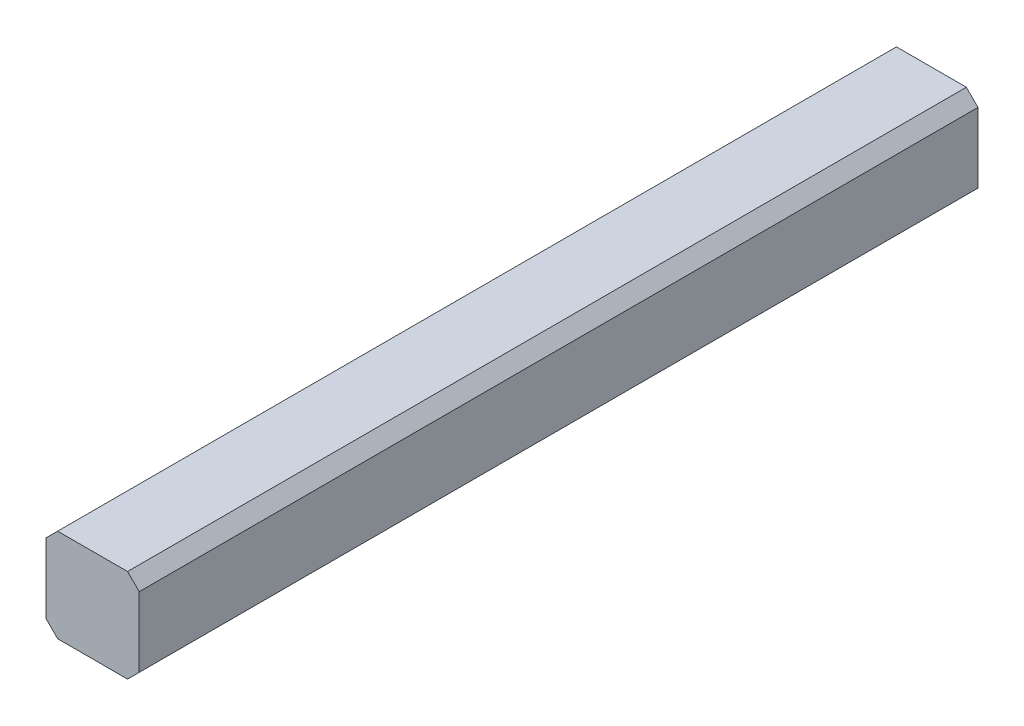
ISO-10303-21;
HEADER;
FILE_DESCRIPTION(('STEP AP214'),'2;1');
FILE_NAME('part.step','',(''),(''),'','','');
FILE_SCHEMA(('AUTOMOTIVE_DESIGN { 1 0 10303 214 1 1 1 1 }'));
ENDSEC;
DATA;
#1=APPLICATION_CONTEXT('core data for automotive mechanical design processes');
#2=APPLICATION_PROTOCOL_DEFINITION('international standard','automotive_design',2000,#1);
#3=PRODUCT_CONTEXT('',#1,'mechanical');
#4=PRODUCT('Part','Part','',(#3));
#5=PRODUCT_RELATED_PRODUCT_CATEGORY('part','',(#4));
#6=PRODUCT_DEFINITION_FORMATION('','',#4);
#7=PRODUCT_DEFINITION_CONTEXT('part definition',#1,'design');
#8=PRODUCT_DEFINITION('design','',#6,#7);
#9=PRODUCT_DEFINITION_SHAPE('','',#8);
#10=(LENGTH_UNIT() NAMED_UNIT(*) SI_UNIT(.MILLI.,.METRE.));
#11=(NAMED_UNIT(*) PLANE_ANGLE_UNIT() SI_UNIT($,.RADIAN.));
#12=(NAMED_UNIT(*) SI_UNIT($,.STERADIAN.) SOLID_ANGLE_UNIT());
#13=UNCERTAINTY_MEASURE_WITH_UNIT(LENGTH_MEASURE(1.E-05),#10,'distance_accuracy_value','');
#14=(GEOMETRIC_REPRESENTATION_CONTEXT(3) GLOBAL_UNCERTAINTY_ASSIGNED_CONTEXT((#13)) GLOBAL_UNIT_ASSIGNED_CONTEXT((#10,
#11,#12)) REPRESENTATION_CONTEXT('',''));
#15=CARTESIAN_POINT('',(0.,0.,0.));
#16=DIRECTION('',(0.,0.,1.));
#17=DIRECTION('',(1.,0.,0.));
#18=AXIS2_PLACEMENT_3D('',#15,#16,#17);
#19=CARTESIAN_POINT('',(0.,0.,18.));
#20=DIRECTION('',(1.,0.,0.));
#21=DIRECTION('',(0.,0.,-1.));
#22=AXIS2_PLACEMENT_3D('',#19,#20,#21);
#23=PLANE('',#22);
#24=DIRECTION('',(0.,-1.,0.));
#25=VECTOR('',#24,1.);
#26=CARTESIAN_POINT('',(0.,0.,0.));
#27=LINE('',#26,#25);
#28=CARTESIAN_POINT('',(0.,1.75,0.));
#29=VERTEX_POINT('',#28);
#30=CARTESIAN_POINT('',(0.,0.25,0.));
#31=VERTEX_POINT('',#30);
#32=EDGE_CURVE('E126',#29,#31,#27,.T.);
#33=ORIENTED_EDGE('',*,*,#32,.T.);
#34=DIRECTION('',(0.,0.,1.));
#35=VECTOR('',#34,1.);
#36=CARTESIAN_POINT('',(0.,0.25,18.));
#37=LINE('',#36,#35);
#38=CARTESIAN_POINT('',(0.,0.25,18.));
#39=VERTEX_POINT('',#38);
#40=EDGE_CURVE('E104',#31,#39,#37,.T.);
#41=ORIENTED_EDGE('',*,*,#40,.T.);
#42=DIRECTION('',(0.,-1.,0.));
#43=VECTOR('',#42,1.);
#44=CARTESIAN_POINT('',(0.,0.,18.));
#45=LINE('',#44,#43);
#46=CARTESIAN_POINT('',(0.,1.75,18.));
#47=VERTEX_POINT('',#46);
#48=EDGE_CURVE('E135',#47,#39,#45,.T.);
#49=ORIENTED_EDGE('',*,*,#48,.F.);
#50=DIRECTION('',(0.,0.,-1.));
#51=VECTOR('',#50,1.);
#52=CARTESIAN_POINT('',(0.,1.75,18.));
#53=LINE('',#52,#51);
#54=EDGE_CURVE('E109',#47,#29,#53,.T.);
#55=ORIENTED_EDGE('',*,*,#54,.T.);
#56=EDGE_LOOP('',(#33,#41,#49,#55));
#57=FACE_BOUND('',#56,.T.);
#58=ADVANCED_FACE('F33',(#57),#23,.F.);
#59=CARTESIAN_POINT('',(0.,0.,18.));
#60=DIRECTION('',(0.,1.,0.));
#61=DIRECTION('',(0.,0.,1.));
#62=AXIS2_PLACEMENT_3D('',#59,#60,#61);
#63=PLANE('',#62);
#64=DIRECTION('',(1.,0.,0.));
#65=VECTOR('',#64,1.);
#66=CARTESIAN_POINT('',(0.,0.,18.));
#67=LINE('',#66,#65);
#68=CARTESIAN_POINT('',(0.25,0.,18.));
#69=VERTEX_POINT('',#68);
#70=CARTESIAN_POINT('',(1.75,0.,18.));
#71=VERTEX_POINT('',#70);
#72=EDGE_CURVE('E119',#69,#71,#67,.T.);
#73=ORIENTED_EDGE('',*,*,#72,.F.);
#74=DIRECTION('',(0.,0.,-1.));
#75=VECTOR('',#74,1.);
#76=CARTESIAN_POINT('',(0.25,0.,18.));
#77=LINE('',#76,#75);
#78=CARTESIAN_POINT('',(0.25,0.,0.));
#79=VERTEX_POINT('',#78);
#80=EDGE_CURVE('E103',#69,#79,#77,.T.);
#81=ORIENTED_EDGE('',*,*,#80,.T.);
#82=DIRECTION('',(1.,0.,0.));
#83=VECTOR('',#82,1.);
#84=CARTESIAN_POINT('',(0.,0.,0.));
#85=LINE('',#84,#83);
#86=CARTESIAN_POINT('',(1.75,0.,0.));
#87=VERTEX_POINT('',#86);
#88=EDGE_CURVE('E116',#79,#87,#85,.T.);
#89=ORIENTED_EDGE('',*,*,#88,.T.);
#90=DIRECTION('',(0.,0.,1.));
#91=VECTOR('',#90,1.);
#92=CARTESIAN_POINT('',(1.75,0.,18.));
#93=LINE('',#92,#91);
#94=EDGE_CURVE('E121',#87,#71,#93,.T.);
#95=ORIENTED_EDGE('',*,*,#94,.T.);
#96=EDGE_LOOP('',(#73,#81,#89,#95));
#97=FACE_BOUND('',#96,.T.);
#98=ADVANCED_FACE('F115',(#97),#63,.F.);
#99=CARTESIAN_POINT('',(2.,0.,18.));
#100=DIRECTION('',(-1.,0.,0.));
#101=DIRECTION('',(0.,0.,1.));
#102=AXIS2_PLACEMENT_3D('',#99,#100,#101);
#103=PLANE('',#102);
#104=DIRECTION('',(0.,1.,0.));
#105=VECTOR('',#104,1.);
#106=CARTESIAN_POINT('',(2.,0.,18.));
#107=LINE('',#106,#105);
#108=CARTESIAN_POINT('',(2.,0.25,18.));
#109=VERTEX_POINT('',#108);
#110=CARTESIAN_POINT('',(2.,1.75,18.));
#111=VERTEX_POINT('',#110);
#112=EDGE_CURVE('E161',#109,#111,#107,.T.);
#113=ORIENTED_EDGE('',*,*,#112,.F.);
#114=DIRECTION('',(0.,0.,-1.));
#115=VECTOR('',#114,1.);
#116=CARTESIAN_POINT('',(2.,0.25,18.));
#117=LINE('',#116,#115);
#118=CARTESIAN_POINT('',(2.,0.25,0.));
#119=VERTEX_POINT('',#118);
#120=EDGE_CURVE('E154',#109,#119,#117,.T.);
#121=ORIENTED_EDGE('',*,*,#120,.T.);
#122=DIRECTION('',(0.,1.,0.));
#123=VECTOR('',#122,1.);
#124=CARTESIAN_POINT('',(2.,0.,0.));
#125=LINE('',#124,#123);
#126=CARTESIAN_POINT('',(2.,1.75,0.));
#127=VERTEX_POINT('',#126);
#128=EDGE_CURVE('E125',#119,#127,#125,.T.);
#129=ORIENTED_EDGE('',*,*,#128,.T.);
#130=DIRECTION('',(0.,0.,1.));
#131=VECTOR('',#130,1.);
#132=CARTESIAN_POINT('',(2.,1.75,18.));
#133=LINE('',#132,#131);
#134=EDGE_CURVE('E152',#127,#111,#133,.T.);
#135=ORIENTED_EDGE('',*,*,#134,.T.);
#136=EDGE_LOOP('',(#113,#121,#129,#135));
#137=FACE_BOUND('',#136,.T.);
#138=ADVANCED_FACE('F159',(#137),#103,.F.);
#139=CARTESIAN_POINT('',(0.,2.,18.));
#140=DIRECTION('',(0.,-1.,0.));
#141=DIRECTION('',(0.,0.,-1.));
#142=AXIS2_PLACEMENT_3D('',#139,#140,#141);
#143=PLANE('',#142);
#144=DIRECTION('',(-1.,0.,0.));
#145=VECTOR('',#144,1.);
#146=CARTESIAN_POINT('',(0.,2.,18.));
#147=LINE('',#146,#145);
#148=CARTESIAN_POINT('',(1.75,2.,18.));
#149=VERTEX_POINT('',#148);
#150=CARTESIAN_POINT('',(0.249999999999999,2.,18.));
#151=VERTEX_POINT('',#150);
#152=EDGE_CURVE('E136',#149,#151,#147,.T.);
#153=ORIENTED_EDGE('',*,*,#152,.F.);
#154=DIRECTION('',(0.,0.,-1.));
#155=VECTOR('',#154,1.);
#156=CARTESIAN_POINT('',(1.75,2.,18.));
#157=LINE('',#156,#155);
#158=CARTESIAN_POINT('',(1.75,2.,0.));
#159=VERTEX_POINT('',#158);
#160=EDGE_CURVE('E11',#149,#159,#157,.T.);
#161=ORIENTED_EDGE('',*,*,#160,.T.);
#162=DIRECTION('',(-1.,0.,0.));
#163=VECTOR('',#162,1.);
#164=CARTESIAN_POINT('',(0.,2.,0.));
#165=LINE('',#164,#163);
#166=CARTESIAN_POINT('',(0.249999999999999,2.,0.));
#167=VERTEX_POINT('',#166);
#168=EDGE_CURVE('E129',#159,#167,#165,.T.);
#169=ORIENTED_EDGE('',*,*,#168,.T.);
#170=DIRECTION('',(0.,0.,1.));
#171=VECTOR('',#170,1.);
#172=CARTESIAN_POINT('',(0.249999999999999,2.,18.));
#173=LINE('',#172,#171);
#174=EDGE_CURVE('E41',#167,#151,#173,.T.);
#175=ORIENTED_EDGE('',*,*,#174,.T.);
#176=EDGE_LOOP('',(#153,#161,#169,#175));
#177=FACE_BOUND('',#176,.T.);
#178=ADVANCED_FACE('F168',(#177),#143,.F.);
#179=CARTESIAN_POINT('',(0.,2.,18.));
#180=DIRECTION('',(0.,0.,-1.));
#181=DIRECTION('',(-1.,0.,0.));
#182=AXIS2_PLACEMENT_3D('',#179,#180,#181);
#183=PLANE('',#182);
#184=ORIENTED_EDGE('',*,*,#48,.T.);
#185=DIRECTION('',(-0.707106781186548,0.707106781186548,0.));
#186=VECTOR('',#185,1.);
#187=CARTESIAN_POINT('',(0.25,0.,18.));
#188=LINE('',#187,#186);
#189=EDGE_CURVE('E150',#39,#69,#188,.F.);
#190=ORIENTED_EDGE('',*,*,#189,.T.);
#191=ORIENTED_EDGE('',*,*,#72,.T.);
#192=DIRECTION('',(-0.707106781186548,-0.707106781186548,0.));
#193=VECTOR('',#192,1.);
#194=CARTESIAN_POINT('',(2.,0.25,18.));
#195=LINE('',#194,#193);
#196=EDGE_CURVE('E148',#71,#109,#195,.F.);
#197=ORIENTED_EDGE('',*,*,#196,.T.);
#198=ORIENTED_EDGE('',*,*,#112,.T.);
#199=DIRECTION('',(0.707106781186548,-0.707106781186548,0.));
#200=VECTOR('',#199,1.);
#201=CARTESIAN_POINT('',(1.75,2.,18.));
#202=LINE('',#201,#200);
#203=EDGE_CURVE('E54',#111,#149,#202,.F.);
#204=ORIENTED_EDGE('',*,*,#203,.T.);
#205=ORIENTED_EDGE('',*,*,#152,.T.);
#206=DIRECTION('',(0.707106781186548,0.707106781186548,0.));
#207=VECTOR('',#206,1.);
#208=CARTESIAN_POINT('',(0.,1.75,18.));
#209=LINE('',#208,#207);
#210=EDGE_CURVE('E145',#151,#47,#209,.F.);
#211=ORIENTED_EDGE('',*,*,#210,.T.);
#212=EDGE_LOOP('',(#184,#190,#191,#197,#198,#204,#205,#211));
#213=FACE_BOUND('',#212,.T.);
#214=ADVANCED_FACE('F175',(#213),#183,.F.);
#215=CARTESIAN_POINT('',(0.,2.,0.));
#216=DIRECTION('',(0.,0.,-1.));
#217=DIRECTION('',(-1.,0.,0.));
#218=AXIS2_PLACEMENT_3D('',#215,#216,#217);
#219=PLANE('',#218);
#220=ORIENTED_EDGE('',*,*,#88,.F.);
#221=DIRECTION('',(0.707106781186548,-0.707106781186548,0.));
#222=VECTOR('',#221,1.);
#223=CARTESIAN_POINT('',(-0.875,1.125,0.));
#224=LINE('',#223,#222);
#225=EDGE_CURVE('E99',#79,#31,#224,.F.);
#226=ORIENTED_EDGE('',*,*,#225,.T.);
#227=ORIENTED_EDGE('',*,*,#32,.F.);
#228=DIRECTION('',(-0.707106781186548,-0.707106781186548,0.));
#229=VECTOR('',#228,1.);
#230=CARTESIAN_POINT('',(0.124999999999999,1.875,0.));
#231=LINE('',#230,#229);
#232=EDGE_CURVE('E120',#29,#167,#231,.F.);
#233=ORIENTED_EDGE('',*,*,#232,.T.);
#234=ORIENTED_EDGE('',*,*,#168,.F.);
#235=DIRECTION('',(-0.707106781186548,0.707106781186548,0.));
#236=VECTOR('',#235,1.);
#237=CARTESIAN_POINT('',(0.874999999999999,2.875,0.));
#238=LINE('',#237,#236);
#239=EDGE_CURVE('E139',#159,#127,#238,.F.);
#240=ORIENTED_EDGE('',*,*,#239,.T.);
#241=ORIENTED_EDGE('',*,*,#128,.F.);
#242=DIRECTION('',(0.707106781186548,0.707106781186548,0.));
#243=VECTOR('',#242,1.);
#244=CARTESIAN_POINT('',(1.875,0.125000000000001,0.));
#245=LINE('',#244,#243);
#246=EDGE_CURVE('E110',#119,#87,#245,.F.);
#247=ORIENTED_EDGE('',*,*,#246,.T.);
#248=EDGE_LOOP('',(#220,#226,#227,#233,#234,#240,#241,#247));
#249=FACE_BOUND('',#248,.T.);
#250=ADVANCED_FACE('F123',(#249),#219,.T.);
#251=CARTESIAN_POINT('',(0.25,0.,18.));
#252=DIRECTION('',(0.707106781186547,0.707106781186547,0.));
#253=DIRECTION('',(-0.707106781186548,0.707106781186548,0.));
#254=AXIS2_PLACEMENT_3D('',#251,#252,#253);
#255=PLANE('',#254);
#256=ORIENTED_EDGE('',*,*,#189,.F.);
#257=ORIENTED_EDGE('',*,*,#40,.F.);
#258=ORIENTED_EDGE('',*,*,#225,.F.);
#259=ORIENTED_EDGE('',*,*,#80,.F.);
#260=EDGE_LOOP('',(#256,#257,#258,#259));
#261=FACE_BOUND('',#260,.T.);
#262=ADVANCED_FACE('F102',(#261),#255,.F.);
#263=CARTESIAN_POINT('',(2.,0.25,18.));
#264=DIRECTION('',(-0.707106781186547,0.707106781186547,0.));
#265=DIRECTION('',(-0.707106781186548,-0.707106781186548,0.));
#266=AXIS2_PLACEMENT_3D('',#263,#264,#265);
#267=PLANE('',#266);
#268=ORIENTED_EDGE('',*,*,#196,.F.);
#269=ORIENTED_EDGE('',*,*,#94,.F.);
#270=ORIENTED_EDGE('',*,*,#246,.F.);
#271=ORIENTED_EDGE('',*,*,#120,.F.);
#272=EDGE_LOOP('',(#268,#269,#270,#271));
#273=FACE_BOUND('',#272,.T.);
#274=ADVANCED_FACE('F183',(#273),#267,.F.);
#275=CARTESIAN_POINT('',(1.75,2.,18.));
#276=DIRECTION('',(-0.707106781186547,-0.707106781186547,0.));
#277=DIRECTION('',(0.707106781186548,-0.707106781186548,0.));
#278=AXIS2_PLACEMENT_3D('',#275,#276,#277);
#279=PLANE('',#278);
#280=ORIENTED_EDGE('',*,*,#203,.F.);
#281=ORIENTED_EDGE('',*,*,#134,.F.);
#282=ORIENTED_EDGE('',*,*,#239,.F.);
#283=ORIENTED_EDGE('',*,*,#160,.F.);
#284=EDGE_LOOP('',(#280,#281,#282,#283));
#285=FACE_BOUND('',#284,.T.);
#286=ADVANCED_FACE('F167',(#285),#279,.F.);
#287=CARTESIAN_POINT('',(0.,1.75,18.));
#288=DIRECTION('',(0.707106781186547,-0.707106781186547,0.));
#289=DIRECTION('',(0.707106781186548,0.707106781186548,0.));
#290=AXIS2_PLACEMENT_3D('',#287,#288,#289);
#291=PLANE('',#290);
#292=ORIENTED_EDGE('',*,*,#210,.F.);
#293=ORIENTED_EDGE('',*,*,#174,.F.);
#294=ORIENTED_EDGE('',*,*,#232,.F.);
#295=ORIENTED_EDGE('',*,*,#54,.F.);
#296=EDGE_LOOP('',(#292,#293,#294,#295));
#297=FACE_BOUND('',#296,.T.);
#298=ADVANCED_FACE('F35',(#297),#291,.F.);
#299=CLOSED_SHELL('',(#58,#98,#138,#178,#214,#250,#262,#274,#286,#298));
#300=MANIFOLD_SOLID_BREP('B2',#299);
#301=ADVANCED_BREP_SHAPE_REPRESENTATION('',(#18,#300),#14);
#302=SHAPE_DEFINITION_REPRESENTATION(#9,#301);
ENDSEC;
END-ISO-10303-21;
